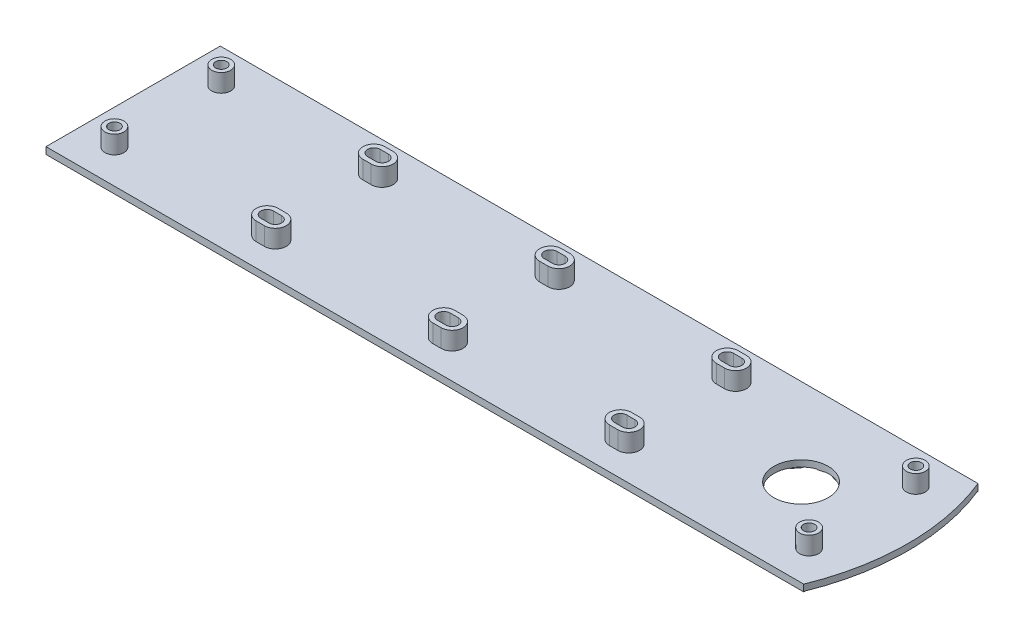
from build123d import *

# Parameters (mm, degrees)
SKETCH1_W           = 156.1
SKETCH1_H           = 35.9
SKETCH1_R           = 5.6
BOSS_EXTRUDE1_DEPTH = 1.3
SKETCH2_R           = 1.95
SKETCH2_R_2         = 1.15
BOSS_EXTRUDE2_DEPTH = 3.7
BOSS_EXTRUDE3_START = 0.1
SKETCH3_W           = 1.2
SKETCH3_H           = 35.9
BOSS_EXTRUDE3_DEPTH = 0.1
SKETCH4_W           = 154.856313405
SKETCH4_H           = 1.3
BOSS_EXTRUDE4_DEPTH = 0.1
SKETCH5_W           = 58.7
SKETCH5_H           = 24.3
CUT_EXTRUDE1_DEPTH  = 0.1
BOSS_EXTRUDE6_DEPTH = 1.3


with BuildPart() as part:
    # Sketch1 → Boss-Extrude1 (new body)
    with BuildSketch(Plane(origin=(0, 0, 0), x_dir=(1, 0, 0), z_dir=(0, 1, 0))):
        Rectangle(SKETCH1_W, SKETCH1_H)
        with Locations(Location((59.55, 0, 0), (0, 0, 270))):
            Circle(SKETCH1_R, mode=Mode.SUBTRACT)
    extrude(amount=BOSS_EXTRUDE1_DEPTH)

    # Sketch2 → Boss-Extrude2 (add)
    # profile 1 of 10: a face of its own
    with BuildSketch(Plane(origin=(0, 1.3, 0), x_dir=(1, 0, 0), z_dir=(0, 1, 0))):
        with Locations(Location((-70.9, 11, 0), (0, 0, 90))):
            Circle(SKETCH2_R)
        with Locations(Location((-70.9, 11, 0), (0, 0, 270))):
            Circle(SKETCH2_R_2, mode=Mode.SUBTRACT)
    # profile 2 of 10: a face of its own
    with BuildSketch(Plane(origin=(0, 1.3, 0), x_dir=(1, 0, 0), z_dir=(0, 1, 0))):
        with Locations(Location((72.2, 11, 0), (0, 0, 90))):
            Circle(SKETCH2_R)
        with Locations(Location((72.2, 11, 0), (0, 0, 270))):
            Circle(SKETCH2_R_2, mode=Mode.SUBTRACT)
    # profile 3 of 10: a face of its own
    with BuildSketch(Plane(origin=(0, 1.3, 0), x_dir=(1, 0, 0), z_dir=(0, 1, 0))):
        with Locations(Location((72.2, -11, 0), (0, 0, 90))):
            Circle(SKETCH2_R)
        with Locations(Location((72.2, -11, 0), (0, 0, 90))):
            Circle(SKETCH2_R_2, mode=Mode.SUBTRACT)
    # profile 4 of 10: a face of its own
    with BuildSketch(Plane(origin=(0, 1.3, 0), x_dir=(1, 0, 0), z_dir=(0, 1, 0))):
        with Locations(Location((-70.9, -11, 0), (0, 0, 90))):
            Circle(SKETCH2_R)
        with Locations(Location((-70.9, -11, 0), (0, 0, 90))):
            Circle(SKETCH2_R_2, mode=Mode.SUBTRACT)
    # profile 5 of 10: a face of its own
    with BuildSketch(Plane(origin=(0, 1.3, 0), x_dir=(1, 0, 0), z_dir=(0, 1, 0))):
        with BuildLine():
            Line((-39.45, 13.25), (-37.75, 13.25))
            ThreePointArc((-37.75, 13.25), (-35.5, 11), (-37.75, 8.75))
            Line((-37.75, 8.75), (-39.45, 8.75))
            ThreePointArc((-39.45, 8.75), (-41.7, 11), (-39.45, 13.25))
        make_face()
        with BuildLine():
            Line((-39.45, 12.3), (-37.75, 12.3))
            ThreePointArc((-37.75, 12.3), (-36.45, 11), (-37.75, 9.7))
            Line((-37.75, 9.7), (-39.45, 9.7))
            ThreePointArc((-39.45, 9.7), (-40.75, 11), (-39.45, 12.3))
        make_face(mode=Mode.SUBTRACT)
    # profile 6 of 10: a face of its own
    with BuildSketch(Plane(origin=(0, 1.3, 0), x_dir=(1, 0, 0), z_dir=(0, 1, 0))):
        with BuildLine():
            Line((-3.05, 13.25), (-1.35, 13.25))
            ThreePointArc((-1.35, 13.25), (0.9, 11), (-1.35, 8.75))
            Line((-1.35, 8.75), (-3.05, 8.75))
            ThreePointArc((-3.05, 8.75), (-5.3, 11), (-3.05, 13.25))
        make_face()
        with BuildLine():
            Line((-3.05, 12.3), (-1.35, 12.3))
            ThreePointArc((-1.35, 12.3), (-0.05, 11), (-1.35, 9.7))
            Line((-1.35, 9.7), (-3.05, 9.7))
            ThreePointArc((-3.05, 9.7), (-4.35, 11), (-3.05, 12.3))
        make_face(mode=Mode.SUBTRACT)
    # profile 7 of 10: a face of its own
    with BuildSketch(Plane(origin=(0, 1.3, 0), x_dir=(1, 0, 0), z_dir=(0, 1, 0))):
        with BuildLine():
            Line((33.35, 13.25), (35.05, 13.25))
            ThreePointArc((35.05, 13.25), (37.3, 11), (35.05, 8.75))
            Line((35.05, 8.75), (33.35, 8.75))
            ThreePointArc((33.35, 8.75), (31.1, 11), (33.35, 13.25))
        make_face()
        with BuildLine():
            Line((33.35, 12.3), (35.05, 12.3))
            ThreePointArc((35.05, 12.3), (36.35, 11), (35.05, 9.7))
            Line((35.05, 9.7), (33.35, 9.7))
            ThreePointArc((33.35, 9.7), (32.05, 11), (33.35, 12.3))
        make_face(mode=Mode.SUBTRACT)
    # profile 8 of 10: a face of its own
    with BuildSketch(Plane(origin=(0, 1.3, 0), x_dir=(1, 0, 0), z_dir=(0, 1, 0))):
        with BuildLine():
            Line((33.35, -13.25), (35.05, -13.25))
            ThreePointArc((35.05, -13.25), (37.3, -11), (35.05, -8.75))
            Line((35.05, -8.75), (33.35, -8.75))
            ThreePointArc((33.35, -8.75), (31.1, -11), (33.35, -13.25))
        make_face()
        with BuildLine():
            Line((33.35, -12.3), (35.05, -12.3))
            ThreePointArc((35.05, -12.3), (36.35, -11), (35.05, -9.7))
            Line((35.05, -9.7), (33.35, -9.7))
            ThreePointArc((33.35, -9.7), (32.05, -11), (33.35, -12.3))
        make_face(mode=Mode.SUBTRACT)
    # profile 9 of 10: a face of its own
    with BuildSketch(Plane(origin=(0, 1.3, 0), x_dir=(1, 0, 0), z_dir=(0, 1, 0))):
        with BuildLine():
            Line((-3.05, -13.25), (-1.35, -13.25))
            ThreePointArc((-1.35, -13.25), (0.9, -11), (-1.35, -8.75))
            Line((-1.35, -8.75), (-3.05, -8.75))
            ThreePointArc((-3.05, -8.75), (-5.3, -11), (-3.05, -13.25))
        make_face()
        with BuildLine():
            Line((-3.05, -12.3), (-1.35, -12.3))
            ThreePointArc((-1.35, -12.3), (-0.05, -11), (-1.35, -9.7))
            Line((-1.35, -9.7), (-3.05, -9.7))
            ThreePointArc((-3.05, -9.7), (-4.35, -11), (-3.05, -12.3))
        make_face(mode=Mode.SUBTRACT)
    # profile 10 of 10: a face of its own
    with BuildSketch(Plane(origin=(0, 1.3, 0), x_dir=(1, 0, 0), z_dir=(0, 1, 0))):
        with BuildLine():
            Line((-39.45, -13.25), (-37.75, -13.25))
            ThreePointArc((-37.75, -13.25), (-35.5, -11), (-37.75, -8.75))
            Line((-37.75, -8.75), (-39.45, -8.75))
            ThreePointArc((-39.45, -8.75), (-41.7, -11), (-39.45, -13.25))
        make_face()
        with BuildLine():
            Line((-39.45, -12.3), (-37.75, -12.3))
            ThreePointArc((-37.75, -12.3), (-36.45, -11), (-37.75, -9.7))
            Line((-37.75, -9.7), (-39.45, -9.7))
            ThreePointArc((-39.45, -9.7), (-40.75, -11), (-39.45, -12.3))
        make_face(mode=Mode.SUBTRACT)
    extrude(amount=BOSS_EXTRUDE2_DEPTH)

    # Sketch3 → Boss-Extrude3 (add)
    with BuildSketch(Plane.XZ.offset(BOSS_EXTRUDE3_START)):
        with Locations((10.193686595, 0)):
            Rectangle(SKETCH3_W, SKETCH3_H)
        with Locations((13.193686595, 0)):
            Rectangle(SKETCH3_W, SKETCH3_H)
        with Locations((19.193686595, 0)):
            Rectangle(SKETCH3_W, SKETCH3_H)
        with Locations((25.193686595, 0)):
            Rectangle(SKETCH3_W, SKETCH3_H)
        with Locations((31.193686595, 0)):
            Rectangle(SKETCH3_W, SKETCH3_H)
        with Locations((34.193686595, 0)):
            Rectangle(SKETCH3_W, SKETCH3_H)
        with Locations((43.193686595, 0)):
            Rectangle(SKETCH3_W, SKETCH3_H)
        with BuildLine():
            Line((57.593686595, -5.247174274), (57.593686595, -17.95))
            Line((57.593686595, -17.95), (58.793686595, -17.95))
            Line((58.793686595, -17.95), (58.793686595, -5.548692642))
            ThreePointArc((58.793686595, -5.548692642), (58.185333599, -5.431177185), (57.593686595, -5.247174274))
        make_face()
        with Locations((67.193686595, 0)):
            Rectangle(SKETCH3_W, SKETCH3_H)
        with Locations((70.193686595, 0)):
            Rectangle(SKETCH3_W, SKETCH3_H)
        with Locations((73.193686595, 0)):
            Rectangle(SKETCH3_W, SKETCH3_H)
        with Locations((76.193686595, 0)):
            Rectangle(SKETCH3_W, SKETCH3_H)
        with BuildLine():
            Line((64.793686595, 17.95), (63.593686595, 17.95))
            Line((63.593686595, 17.95), (63.593686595, 3.874093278))
            ThreePointArc((63.593686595, 3.874093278), (64.290714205, 2.980877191), (64.793686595, 1.965642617))
            Line((64.793686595, 1.965642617), (64.793686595, 17.95))
        make_face()
        with BuildLine():
            Line((61.793686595, 17.95), (60.593686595, 17.95))
            Line((60.593686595, 17.95), (60.593686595, 5.501883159))
            ThreePointArc((60.593686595, 5.501883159), (61.204121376, 5.350129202), (61.793686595, 5.13087424))
            Line((61.793686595, 5.13087424), (61.793686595, 17.95))
        make_face()
        with Locations((-73.206313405, 0)):
            Rectangle(SKETCH3_W, SKETCH3_H)
        with Locations((-69.006313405, 0)):
            Rectangle(SKETCH3_W, SKETCH3_H)
        with Locations((-64.806313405, 0)):
            Rectangle(SKETCH3_W, SKETCH3_H)
        with Locations((-77.406313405, 0)):
            Rectangle(SKETCH3_W, SKETCH3_H)
        with Locations((7.193686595, 0)):
            Rectangle(SKETCH3_W, SKETCH3_H)
        with Locations((16.193686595, 0)):
            Rectangle(SKETCH3_W, SKETCH3_H)
        with Locations((22.193686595, 0)):
            Rectangle(SKETCH3_W, SKETCH3_H)
        with Locations((28.193686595, 0)):
            Rectangle(SKETCH3_W, SKETCH3_H)
        with Locations((37.193686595, 0)):
            Rectangle(SKETCH3_W, SKETCH3_H)
        with Locations((40.193686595, 0)):
            Rectangle(SKETCH3_W, SKETCH3_H)
        with Locations((46.193686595, 0)):
            Rectangle(SKETCH3_W, SKETCH3_H)
        with Locations((49.193686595, 0)):
            Rectangle(SKETCH3_W, SKETCH3_H)
        with Locations((52.193686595, 0)):
            Rectangle(SKETCH3_W, SKETCH3_H)
        Polygon((54.593686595, -2.606713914), (54.593686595, -17.95), (55.793686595, -17.95), (55.793686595, -4.153325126), align=None)
        Polygon((60.593686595, -17.95), (60.593686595, -5.501883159), (61.793686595, -5.13087424), (61.793686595, -17.95), align=None)
        Polygon((63.593686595, -17.95), (63.593686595, -3.874093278), (64.793686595, -1.965642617), (64.793686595, -17.95), align=None)
        Polygon((58.793686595, 5.548692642), (58.793686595, 17.95), (57.593686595, 17.95), (57.593686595, 5.247174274), align=None)
        Polygon((55.793686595, 17.95), (55.793686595, 4.153325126), (54.593686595, 2.606713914), (54.593686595, 17.95), align=None)
    extrude(amount=-BOSS_EXTRUDE3_DEPTH)

    # Sketch4 → Boss-Extrude4 (add)
    with BuildSketch(Plane.XZ):
        with Locations((0.621843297, 17.3)):
            Rectangle(SKETCH4_W, SKETCH4_H)
        with Locations((0.621843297, -17.3)):
            Rectangle(SKETCH4_W, SKETCH4_H)
    extrude(amount=BOSS_EXTRUDE4_DEPTH)

    # Sketch5 → Cut-Extrude1 (cut)
    with BuildSketch(Plane.XZ):
        with Locations((-31.656313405, 0)):
            Rectangle(SKETCH5_W, SKETCH5_H)
    extrude(amount=-CUT_EXTRUDE1_DEPTH, mode=Mode.SUBTRACT)

    # Sketch7 → Boss-Extrude6 (add)
    with BuildSketch(Plane(origin=(0, 1.3, 0), x_dir=(1, 0, 0), z_dir=(0, 1, 0))):
        with BuildLine():
            Line((78.05, 17.95), (78.05, -17.95))
            ThreePointArc((78.05, -17.95), (81.553842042, 0), (78.05, 17.95))
        make_face()
    extrude(amount=-BOSS_EXTRUDE6_DEPTH)


solid = part.part
